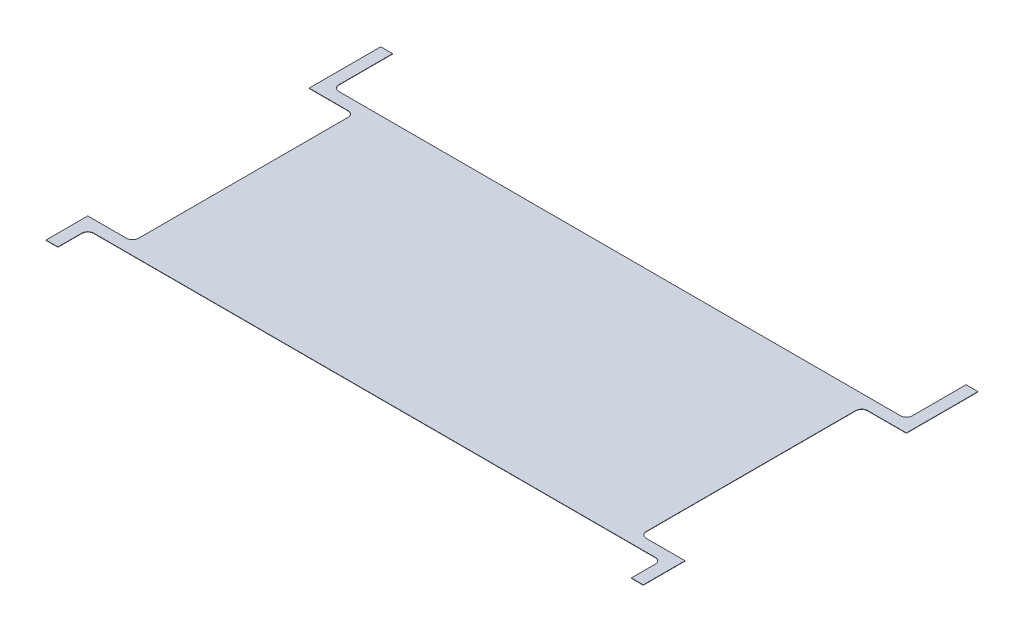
ISO-10303-21;
HEADER;
FILE_DESCRIPTION(('STEP AP214'),'2;1');
FILE_NAME('part.step','',(''),(''),'','','');
FILE_SCHEMA(('AUTOMOTIVE_DESIGN { 1 0 10303 214 1 1 1 1 }'));
ENDSEC;
DATA;
#1=APPLICATION_CONTEXT('core data for automotive mechanical design processes');
#2=APPLICATION_PROTOCOL_DEFINITION('international standard','automotive_design',2000,#1);
#3=PRODUCT_CONTEXT('',#1,'mechanical');
#4=PRODUCT('Part','Part','',(#3));
#5=PRODUCT_RELATED_PRODUCT_CATEGORY('part','',(#4));
#6=PRODUCT_DEFINITION_FORMATION('','',#4);
#7=PRODUCT_DEFINITION_CONTEXT('part definition',#1,'design');
#8=PRODUCT_DEFINITION('design','',#6,#7);
#9=PRODUCT_DEFINITION_SHAPE('','',#8);
#10=(LENGTH_UNIT() NAMED_UNIT(*) SI_UNIT(.MILLI.,.METRE.));
#11=(NAMED_UNIT(*) PLANE_ANGLE_UNIT() SI_UNIT($,.RADIAN.));
#12=(NAMED_UNIT(*) SI_UNIT($,.STERADIAN.) SOLID_ANGLE_UNIT());
#13=UNCERTAINTY_MEASURE_WITH_UNIT(LENGTH_MEASURE(1.E-05),#10,'distance_accuracy_value','');
#14=(GEOMETRIC_REPRESENTATION_CONTEXT(3) GLOBAL_UNCERTAINTY_ASSIGNED_CONTEXT((#13)) GLOBAL_UNIT_ASSIGNED_CONTEXT((#10,
#11,#12)) REPRESENTATION_CONTEXT('',''));
#15=CARTESIAN_POINT('',(0.,0.,0.));
#16=DIRECTION('',(0.,0.,1.));
#17=DIRECTION('',(1.,0.,0.));
#18=AXIS2_PLACEMENT_3D('',#15,#16,#17);
#19=CARTESIAN_POINT('',(0.,0.05,0.));
#20=DIRECTION('',(1.,0.,0.));
#21=DIRECTION('',(0.,0.,-1.));
#22=AXIS2_PLACEMENT_3D('',#19,#20,#21);
#23=PLANE('',#22);
#24=DIRECTION('',(0.,0.,1.));
#25=VECTOR('',#24,1.);
#26=CARTESIAN_POINT('',(0.,0.,0.));
#27=LINE('',#26,#25);
#28=CARTESIAN_POINT('',(0.,0.,-7.));
#29=VERTEX_POINT('',#28);
#30=CARTESIAN_POINT('',(0.,0.,0.));
#31=VERTEX_POINT('',#30);
#32=EDGE_CURVE('E253',#29,#31,#27,.T.);
#33=ORIENTED_EDGE('',*,*,#32,.T.);
#34=DIRECTION('',(0.,-1.,0.));
#35=VECTOR('',#34,1.);
#36=CARTESIAN_POINT('',(0.,0.05,0.));
#37=LINE('',#36,#35);
#38=CARTESIAN_POINT('',(0.,0.05,0.));
#39=VERTEX_POINT('',#38);
#40=EDGE_CURVE('E11',#39,#31,#37,.T.);
#41=ORIENTED_EDGE('',*,*,#40,.F.);
#42=DIRECTION('',(0.,0.,1.));
#43=VECTOR('',#42,1.);
#44=CARTESIAN_POINT('',(0.,0.05,0.));
#45=LINE('',#44,#43);
#46=CARTESIAN_POINT('',(0.,0.05,-7.));
#47=VERTEX_POINT('',#46);
#48=EDGE_CURVE('E307',#47,#39,#45,.T.);
#49=ORIENTED_EDGE('',*,*,#48,.F.);
#50=DIRECTION('',(0.,-1.,0.));
#51=VECTOR('',#50,1.);
#52=CARTESIAN_POINT('',(0.,0.05,-7.));
#53=LINE('',#52,#51);
#54=EDGE_CURVE('E249',#47,#29,#53,.T.);
#55=ORIENTED_EDGE('',*,*,#54,.T.);
#56=EDGE_LOOP('',(#33,#41,#49,#55));
#57=FACE_BOUND('',#56,.T.);
#58=ADVANCED_FACE('F37',(#57),#23,.F.);
#59=CARTESIAN_POINT('',(0.,0.05,0.));
#60=DIRECTION('',(0.,0.,-1.));
#61=DIRECTION('',(-1.,0.,0.));
#62=AXIS2_PLACEMENT_3D('',#59,#60,#61);
#63=PLANE('',#62);
#64=DIRECTION('',(1.,0.,0.));
#65=VECTOR('',#64,1.);
#66=CARTESIAN_POINT('',(0.,0.,0.));
#67=LINE('',#66,#65);
#68=CARTESIAN_POINT('',(2.,0.,0.));
#69=VERTEX_POINT('',#68);
#70=EDGE_CURVE('E256',#31,#69,#67,.T.);
#71=ORIENTED_EDGE('',*,*,#70,.T.);
#72=DIRECTION('',(0.,-1.,0.));
#73=VECTOR('',#72,1.);
#74=CARTESIAN_POINT('',(2.,0.05,0.));
#75=LINE('',#74,#73);
#76=CARTESIAN_POINT('',(2.,0.05,0.));
#77=VERTEX_POINT('',#76);
#78=EDGE_CURVE('E45',#77,#69,#75,.T.);
#79=ORIENTED_EDGE('',*,*,#78,.F.);
#80=DIRECTION('',(1.,0.,0.));
#81=VECTOR('',#80,1.);
#82=CARTESIAN_POINT('',(0.,0.05,0.));
#83=LINE('',#82,#81);
#84=EDGE_CURVE('E156',#39,#77,#83,.T.);
#85=ORIENTED_EDGE('',*,*,#84,.F.);
#86=ORIENTED_EDGE('',*,*,#40,.T.);
#87=EDGE_LOOP('',(#71,#79,#85,#86));
#88=FACE_BOUND('',#87,.T.);
#89=ADVANCED_FACE('F465',(#88),#63,.F.);
#90=CARTESIAN_POINT('',(2.,0.05,0.));
#91=DIRECTION('',(-1.,0.,0.));
#92=DIRECTION('',(0.,0.,1.));
#93=AXIS2_PLACEMENT_3D('',#90,#91,#92);
#94=PLANE('',#93);
#95=DIRECTION('',(0.,0.,-1.));
#96=VECTOR('',#95,1.);
#97=CARTESIAN_POINT('',(2.,0.,0.));
#98=LINE('',#97,#96);
#99=CARTESIAN_POINT('',(2.,0.,-3.99999999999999));
#100=VERTEX_POINT('',#99);
#101=EDGE_CURVE('E258',#69,#100,#98,.T.);
#102=ORIENTED_EDGE('',*,*,#101,.T.);
#103=DIRECTION('',(0.,-1.,0.));
#104=VECTOR('',#103,1.);
#105=CARTESIAN_POINT('',(2.,0.05,-3.99999999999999));
#106=LINE('',#105,#104);
#107=CARTESIAN_POINT('',(2.,0.05,-3.99999999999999));
#108=VERTEX_POINT('',#107);
#109=EDGE_CURVE('E374',#108,#100,#106,.T.);
#110=ORIENTED_EDGE('',*,*,#109,.F.);
#111=DIRECTION('',(0.,0.,-1.));
#112=VECTOR('',#111,1.);
#113=CARTESIAN_POINT('',(2.,0.05,0.));
#114=LINE('',#113,#112);
#115=EDGE_CURVE('E382',#77,#108,#114,.T.);
#116=ORIENTED_EDGE('',*,*,#115,.F.);
#117=ORIENTED_EDGE('',*,*,#78,.T.);
#118=EDGE_LOOP('',(#102,#110,#116,#117));
#119=FACE_BOUND('',#118,.T.);
#120=ADVANCED_FACE('F380',(#119),#94,.F.);
#121=CARTESIAN_POINT('',(3.,0.05,-4.));
#122=DIRECTION('',(0.,-1.,0.));
#123=DIRECTION('',(0.,0.,-1.));
#124=AXIS2_PLACEMENT_3D('',#121,#122,#123);
#125=CYLINDRICAL_SURFACE('',#124,1.);
#126=CARTESIAN_POINT('',(3.,0.,-4.));
#127=DIRECTION('',(0.,-1.,0.));
#128=DIRECTION('',(0.,0.,1.));
#129=AXIS2_PLACEMENT_3D('',#126,#127,#128);
#130=CIRCLE('',#129,1.);
#131=CARTESIAN_POINT('',(3.00000000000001,0.,-5.));
#132=VERTEX_POINT('',#131);
#133=EDGE_CURVE('E260',#100,#132,#130,.T.);
#134=ORIENTED_EDGE('',*,*,#133,.T.);
#135=DIRECTION('',(0.,-1.,0.));
#136=VECTOR('',#135,1.);
#137=CARTESIAN_POINT('',(3.00000000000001,0.05,-5.));
#138=LINE('',#137,#136);
#139=CARTESIAN_POINT('',(3.00000000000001,0.05,-5.));
#140=VERTEX_POINT('',#139);
#141=EDGE_CURVE('E371',#140,#132,#138,.T.);
#142=ORIENTED_EDGE('',*,*,#141,.F.);
#143=CARTESIAN_POINT('',(3.,0.05,-4.));
#144=DIRECTION('',(0.,-1.,0.));
#145=DIRECTION('',(0.,0.,1.));
#146=AXIS2_PLACEMENT_3D('',#143,#144,#145);
#147=CIRCLE('',#146,1.);
#148=EDGE_CURVE('E400',#108,#140,#147,.T.);
#149=ORIENTED_EDGE('',*,*,#148,.F.);
#150=ORIENTED_EDGE('',*,*,#109,.T.);
#151=EDGE_LOOP('',(#134,#142,#149,#150));
#152=FACE_BOUND('',#151,.T.);
#153=ADVANCED_FACE('F391',(#152),#125,.F.);
#154=CARTESIAN_POINT('',(3.00000000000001,0.05,-5.));
#155=DIRECTION('',(0.,0.,-1.));
#156=DIRECTION('',(-1.,0.,0.));
#157=AXIS2_PLACEMENT_3D('',#154,#155,#156);
#158=PLANE('',#157);
#159=DIRECTION('',(1.,0.,0.));
#160=VECTOR('',#159,1.);
#161=CARTESIAN_POINT('',(3.00000000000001,0.,-5.));
#162=LINE('',#161,#160);
#163=CARTESIAN_POINT('',(97.1,0.,-5.));
#164=VERTEX_POINT('',#163);
#165=EDGE_CURVE('E262',#132,#164,#162,.T.);
#166=ORIENTED_EDGE('',*,*,#165,.T.);
#167=DIRECTION('',(0.,-1.,0.));
#168=VECTOR('',#167,1.);
#169=CARTESIAN_POINT('',(97.1,0.05,-5.));
#170=LINE('',#169,#168);
#171=CARTESIAN_POINT('',(97.1,0.05,-5.));
#172=VERTEX_POINT('',#171);
#173=EDGE_CURVE('E368',#172,#164,#170,.T.);
#174=ORIENTED_EDGE('',*,*,#173,.F.);
#175=DIRECTION('',(1.,0.,0.));
#176=VECTOR('',#175,1.);
#177=CARTESIAN_POINT('',(3.00000000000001,0.05,-5.));
#178=LINE('',#177,#176);
#179=EDGE_CURVE('E397',#140,#172,#178,.T.);
#180=ORIENTED_EDGE('',*,*,#179,.F.);
#181=ORIENTED_EDGE('',*,*,#141,.T.);
#182=EDGE_LOOP('',(#166,#174,#180,#181));
#183=FACE_BOUND('',#182,.T.);
#184=ADVANCED_FACE('F395',(#183),#158,.F.);
#185=CARTESIAN_POINT('',(97.1,0.05,-4.));
#186=DIRECTION('',(0.,-1.,0.));
#187=DIRECTION('',(0.,0.,-1.));
#188=AXIS2_PLACEMENT_3D('',#185,#186,#187);
#189=CYLINDRICAL_SURFACE('',#188,1.);
#190=CARTESIAN_POINT('',(97.1,0.,-4.));
#191=DIRECTION('',(0.,-1.,0.));
#192=DIRECTION('',(0.,0.,1.));
#193=AXIS2_PLACEMENT_3D('',#190,#191,#192);
#194=CIRCLE('',#193,1.);
#195=CARTESIAN_POINT('',(98.1,0.,-3.99999999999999));
#196=VERTEX_POINT('',#195);
#197=EDGE_CURVE('E264',#164,#196,#194,.T.);
#198=ORIENTED_EDGE('',*,*,#197,.T.);
#199=DIRECTION('',(0.,-1.,0.));
#200=VECTOR('',#199,1.);
#201=CARTESIAN_POINT('',(98.1,0.05,-3.99999999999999));
#202=LINE('',#201,#200);
#203=CARTESIAN_POINT('',(98.1,0.05,-3.99999999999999));
#204=VERTEX_POINT('',#203);
#205=EDGE_CURVE('E365',#204,#196,#202,.T.);
#206=ORIENTED_EDGE('',*,*,#205,.F.);
#207=CARTESIAN_POINT('',(97.1,0.05,-4.));
#208=DIRECTION('',(0.,-1.,0.));
#209=DIRECTION('',(0.,0.,1.));
#210=AXIS2_PLACEMENT_3D('',#207,#208,#209);
#211=CIRCLE('',#210,1.);
#212=EDGE_CURVE('E399',#172,#204,#211,.T.);
#213=ORIENTED_EDGE('',*,*,#212,.F.);
#214=ORIENTED_EDGE('',*,*,#173,.T.);
#215=EDGE_LOOP('',(#198,#206,#213,#214));
#216=FACE_BOUND('',#215,.T.);
#217=ADVANCED_FACE('F478',(#216),#189,.F.);
#218=CARTESIAN_POINT('',(98.1,0.05,-3.99999999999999));
#219=DIRECTION('',(1.,0.,0.));
#220=DIRECTION('',(0.,0.,-1.));
#221=AXIS2_PLACEMENT_3D('',#218,#219,#220);
#222=PLANE('',#221);
#223=DIRECTION('',(0.,0.,1.));
#224=VECTOR('',#223,1.);
#225=CARTESIAN_POINT('',(98.1,0.,-3.99999999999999));
#226=LINE('',#225,#224);
#227=CARTESIAN_POINT('',(98.1,0.,0.));
#228=VERTEX_POINT('',#227);
#229=EDGE_CURVE('E266',#196,#228,#226,.T.);
#230=ORIENTED_EDGE('',*,*,#229,.T.);
#231=DIRECTION('',(0.,-1.,0.));
#232=VECTOR('',#231,1.);
#233=CARTESIAN_POINT('',(98.1,0.05,0.));
#234=LINE('',#233,#232);
#235=CARTESIAN_POINT('',(98.1,0.05,0.));
#236=VERTEX_POINT('',#235);
#237=EDGE_CURVE('E362',#236,#228,#234,.T.);
#238=ORIENTED_EDGE('',*,*,#237,.F.);
#239=DIRECTION('',(0.,0.,1.));
#240=VECTOR('',#239,1.);
#241=CARTESIAN_POINT('',(98.1,0.05,-3.99999999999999));
#242=LINE('',#241,#240);
#243=EDGE_CURVE('E402',#204,#236,#242,.T.);
#244=ORIENTED_EDGE('',*,*,#243,.F.);
#245=ORIENTED_EDGE('',*,*,#205,.T.);
#246=EDGE_LOOP('',(#230,#238,#244,#245));
#247=FACE_BOUND('',#246,.T.);
#248=ADVANCED_FACE('F481',(#247),#222,.F.);
#249=CARTESIAN_POINT('',(98.1,0.05,0.));
#250=DIRECTION('',(0.,0.,-1.));
#251=DIRECTION('',(-1.,0.,0.));
#252=AXIS2_PLACEMENT_3D('',#249,#250,#251);
#253=PLANE('',#252);
#254=DIRECTION('',(1.,0.,0.));
#255=VECTOR('',#254,1.);
#256=CARTESIAN_POINT('',(98.1,0.,0.));
#257=LINE('',#256,#255);
#258=CARTESIAN_POINT('',(100.1,0.,0.));
#259=VERTEX_POINT('',#258);
#260=EDGE_CURVE('E268',#228,#259,#257,.T.);
#261=ORIENTED_EDGE('',*,*,#260,.T.);
#262=DIRECTION('',(0.,-1.,0.));
#263=VECTOR('',#262,1.);
#264=CARTESIAN_POINT('',(100.1,0.05,0.));
#265=LINE('',#264,#263);
#266=CARTESIAN_POINT('',(100.1,0.05,0.));
#267=VERTEX_POINT('',#266);
#268=EDGE_CURVE('E359',#267,#259,#265,.T.);
#269=ORIENTED_EDGE('',*,*,#268,.F.);
#270=DIRECTION('',(1.,0.,0.));
#271=VECTOR('',#270,1.);
#272=CARTESIAN_POINT('',(98.1,0.05,0.));
#273=LINE('',#272,#271);
#274=EDGE_CURVE('E408',#236,#267,#273,.T.);
#275=ORIENTED_EDGE('',*,*,#274,.F.);
#276=ORIENTED_EDGE('',*,*,#237,.T.);
#277=EDGE_LOOP('',(#261,#269,#275,#276));
#278=FACE_BOUND('',#277,.T.);
#279=ADVANCED_FACE('F485',(#278),#253,.F.);
#280=CARTESIAN_POINT('',(100.1,0.05,0.));
#281=DIRECTION('',(-1.,0.,0.));
#282=DIRECTION('',(0.,0.,1.));
#283=AXIS2_PLACEMENT_3D('',#280,#281,#282);
#284=PLANE('',#283);
#285=DIRECTION('',(0.,0.,-1.));
#286=VECTOR('',#285,1.);
#287=CARTESIAN_POINT('',(100.1,0.,0.));
#288=LINE('',#287,#286);
#289=CARTESIAN_POINT('',(100.1,0.,-7.));
#290=VERTEX_POINT('',#289);
#291=EDGE_CURVE('E270',#259,#290,#288,.T.);
#292=ORIENTED_EDGE('',*,*,#291,.T.);
#293=DIRECTION('',(0.,-1.,0.));
#294=VECTOR('',#293,1.);
#295=CARTESIAN_POINT('',(100.1,0.05,-7.));
#296=LINE('',#295,#294);
#297=CARTESIAN_POINT('',(100.1,0.05,-7.));
#298=VERTEX_POINT('',#297);
#299=EDGE_CURVE('E356',#298,#290,#296,.T.);
#300=ORIENTED_EDGE('',*,*,#299,.F.);
#301=DIRECTION('',(0.,0.,-1.));
#302=VECTOR('',#301,1.);
#303=CARTESIAN_POINT('',(100.1,0.05,0.));
#304=LINE('',#303,#302);
#305=EDGE_CURVE('E410',#267,#298,#304,.T.);
#306=ORIENTED_EDGE('',*,*,#305,.F.);
#307=ORIENTED_EDGE('',*,*,#268,.T.);
#308=EDGE_LOOP('',(#292,#300,#306,#307));
#309=FACE_BOUND('',#308,.T.);
#310=ADVANCED_FACE('F489',(#309),#284,.F.);
#311=CARTESIAN_POINT('',(100.1,0.05,-7.));
#312=DIRECTION('',(0.,0.,1.));
#313=DIRECTION('',(1.,0.,0.));
#314=AXIS2_PLACEMENT_3D('',#311,#312,#313);
#315=PLANE('',#314);
#316=DIRECTION('',(-1.,0.,0.));
#317=VECTOR('',#316,1.);
#318=CARTESIAN_POINT('',(100.1,0.,-7.));
#319=LINE('',#318,#317);
#320=CARTESIAN_POINT('',(93.6,0.,-7.));
#321=VERTEX_POINT('',#320);
#322=EDGE_CURVE('E272',#290,#321,#319,.T.);
#323=ORIENTED_EDGE('',*,*,#322,.T.);
#324=DIRECTION('',(0.,-1.,0.));
#325=VECTOR('',#324,1.);
#326=CARTESIAN_POINT('',(93.6,0.05,-7.));
#327=LINE('',#326,#325);
#328=CARTESIAN_POINT('',(93.6,0.05,-7.));
#329=VERTEX_POINT('',#328);
#330=EDGE_CURVE('E353',#329,#321,#327,.T.);
#331=ORIENTED_EDGE('',*,*,#330,.F.);
#332=DIRECTION('',(-1.,0.,0.));
#333=VECTOR('',#332,1.);
#334=CARTESIAN_POINT('',(100.1,0.05,-7.));
#335=LINE('',#334,#333);
#336=EDGE_CURVE('E412',#298,#329,#335,.T.);
#337=ORIENTED_EDGE('',*,*,#336,.F.);
#338=ORIENTED_EDGE('',*,*,#299,.T.);
#339=EDGE_LOOP('',(#323,#331,#337,#338));
#340=FACE_BOUND('',#339,.T.);
#341=ADVANCED_FACE('F493',(#340),#315,.F.);
#342=CARTESIAN_POINT('',(93.6,0.05,-8.));
#343=DIRECTION('',(0.,-1.,0.));
#344=DIRECTION('',(0.,0.,-1.));
#345=AXIS2_PLACEMENT_3D('',#342,#343,#344);
#346=CYLINDRICAL_SURFACE('',#345,1.);
#347=CARTESIAN_POINT('',(93.6,0.,-8.));
#348=DIRECTION('',(0.,-1.,0.));
#349=DIRECTION('',(0.,0.,1.));
#350=AXIS2_PLACEMENT_3D('',#347,#348,#349);
#351=CIRCLE('',#350,1.);
#352=CARTESIAN_POINT('',(92.6,0.,-8.00000000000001));
#353=VERTEX_POINT('',#352);
#354=EDGE_CURVE('E274',#321,#353,#351,.T.);
#355=ORIENTED_EDGE('',*,*,#354,.T.);
#356=DIRECTION('',(0.,-1.,0.));
#357=VECTOR('',#356,1.);
#358=CARTESIAN_POINT('',(92.6,0.05,-8.00000000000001));
#359=LINE('',#358,#357);
#360=CARTESIAN_POINT('',(92.6,0.05,-8.00000000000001));
#361=VERTEX_POINT('',#360);
#362=EDGE_CURVE('E350',#361,#353,#359,.T.);
#363=ORIENTED_EDGE('',*,*,#362,.F.);
#364=CARTESIAN_POINT('',(93.6,0.05,-8.));
#365=DIRECTION('',(0.,-1.,0.));
#366=DIRECTION('',(0.,0.,1.));
#367=AXIS2_PLACEMENT_3D('',#364,#365,#366);
#368=CIRCLE('',#367,1.);
#369=EDGE_CURVE('E414',#329,#361,#368,.T.);
#370=ORIENTED_EDGE('',*,*,#369,.F.);
#371=ORIENTED_EDGE('',*,*,#330,.T.);
#372=EDGE_LOOP('',(#355,#363,#370,#371));
#373=FACE_BOUND('',#372,.T.);
#374=ADVANCED_FACE('F497',(#373),#346,.F.);
#375=CARTESIAN_POINT('',(92.6,0.05,-8.00000000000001));
#376=DIRECTION('',(-1.,0.,0.));
#377=DIRECTION('',(0.,0.,1.));
#378=AXIS2_PLACEMENT_3D('',#375,#376,#377);
#379=PLANE('',#378);
#380=DIRECTION('',(0.,0.,-1.));
#381=VECTOR('',#380,1.);
#382=CARTESIAN_POINT('',(92.6,0.,-8.00000000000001));
#383=LINE('',#382,#381);
#384=CARTESIAN_POINT('',(92.6,0.,-43.1));
#385=VERTEX_POINT('',#384);
#386=EDGE_CURVE('E276',#353,#385,#383,.T.);
#387=ORIENTED_EDGE('',*,*,#386,.T.);
#388=DIRECTION('',(0.,-1.,0.));
#389=VECTOR('',#388,1.);
#390=CARTESIAN_POINT('',(92.6,0.05,-43.1));
#391=LINE('',#390,#389);
#392=CARTESIAN_POINT('',(92.6,0.05,-43.1));
#393=VERTEX_POINT('',#392);
#394=EDGE_CURVE('E347',#393,#385,#391,.T.);
#395=ORIENTED_EDGE('',*,*,#394,.F.);
#396=DIRECTION('',(0.,0.,-1.));
#397=VECTOR('',#396,1.);
#398=CARTESIAN_POINT('',(92.6,0.05,-8.00000000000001));
#399=LINE('',#398,#397);
#400=EDGE_CURVE('E416',#361,#393,#399,.T.);
#401=ORIENTED_EDGE('',*,*,#400,.F.);
#402=ORIENTED_EDGE('',*,*,#362,.T.);
#403=EDGE_LOOP('',(#387,#395,#401,#402));
#404=FACE_BOUND('',#403,.T.);
#405=ADVANCED_FACE('F501',(#404),#379,.F.);
#406=CARTESIAN_POINT('',(93.6,0.05,-43.1));
#407=DIRECTION('',(0.,-1.,0.));
#408=DIRECTION('',(0.,0.,-1.));
#409=AXIS2_PLACEMENT_3D('',#406,#407,#408);
#410=CYLINDRICAL_SURFACE('',#409,1.);
#411=CARTESIAN_POINT('',(93.6,0.,-43.1));
#412=DIRECTION('',(0.,-1.,0.));
#413=DIRECTION('',(0.,0.,-1.));
#414=AXIS2_PLACEMENT_3D('',#411,#412,#413);
#415=CIRCLE('',#414,1.);
#416=CARTESIAN_POINT('',(93.6,0.,-44.1));
#417=VERTEX_POINT('',#416);
#418=EDGE_CURVE('E278',#385,#417,#415,.T.);
#419=ORIENTED_EDGE('',*,*,#418,.T.);
#420=DIRECTION('',(0.,-1.,0.));
#421=VECTOR('',#420,1.);
#422=CARTESIAN_POINT('',(93.6,0.05,-44.1));
#423=LINE('',#422,#421);
#424=CARTESIAN_POINT('',(93.6,0.05,-44.1));
#425=VERTEX_POINT('',#424);
#426=EDGE_CURVE('E344',#425,#417,#423,.T.);
#427=ORIENTED_EDGE('',*,*,#426,.F.);
#428=CARTESIAN_POINT('',(93.6,0.05,-43.1));
#429=DIRECTION('',(0.,-1.,0.));
#430=DIRECTION('',(0.,0.,-1.));
#431=AXIS2_PLACEMENT_3D('',#428,#429,#430);
#432=CIRCLE('',#431,1.);
#433=EDGE_CURVE('E418',#393,#425,#432,.T.);
#434=ORIENTED_EDGE('',*,*,#433,.F.);
#435=ORIENTED_EDGE('',*,*,#394,.T.);
#436=EDGE_LOOP('',(#419,#427,#434,#435));
#437=FACE_BOUND('',#436,.T.);
#438=ADVANCED_FACE('F505',(#437),#410,.F.);
#439=CARTESIAN_POINT('',(93.6,0.05,-44.1));
#440=DIRECTION('',(0.,0.,-1.));
#441=DIRECTION('',(-1.,0.,0.));
#442=AXIS2_PLACEMENT_3D('',#439,#440,#441);
#443=PLANE('',#442);
#444=DIRECTION('',(1.,0.,0.));
#445=VECTOR('',#444,1.);
#446=CARTESIAN_POINT('',(93.6,0.,-44.1));
#447=LINE('',#446,#445);
#448=CARTESIAN_POINT('',(100.1,0.,-44.1));
#449=VERTEX_POINT('',#448);
#450=EDGE_CURVE('E280',#417,#449,#447,.T.);
#451=ORIENTED_EDGE('',*,*,#450,.T.);
#452=DIRECTION('',(0.,-1.,0.));
#453=VECTOR('',#452,1.);
#454=CARTESIAN_POINT('',(100.1,0.05,-44.1));
#455=LINE('',#454,#453);
#456=CARTESIAN_POINT('',(100.1,0.05,-44.1));
#457=VERTEX_POINT('',#456);
#458=EDGE_CURVE('E341',#457,#449,#455,.T.);
#459=ORIENTED_EDGE('',*,*,#458,.F.);
#460=DIRECTION('',(1.,0.,0.));
#461=VECTOR('',#460,1.);
#462=CARTESIAN_POINT('',(93.6,0.05,-44.1));
#463=LINE('',#462,#461);
#464=EDGE_CURVE('E420',#425,#457,#463,.T.);
#465=ORIENTED_EDGE('',*,*,#464,.F.);
#466=ORIENTED_EDGE('',*,*,#426,.T.);
#467=EDGE_LOOP('',(#451,#459,#465,#466));
#468=FACE_BOUND('',#467,.T.);
#469=ADVANCED_FACE('F509',(#468),#443,.F.);
#470=CARTESIAN_POINT('',(100.1,0.05,-44.1));
#471=DIRECTION('',(-1.,0.,0.));
#472=DIRECTION('',(0.,0.,1.));
#473=AXIS2_PLACEMENT_3D('',#470,#471,#472);
#474=PLANE('',#473);
#475=DIRECTION('',(0.,0.,-1.));
#476=VECTOR('',#475,1.);
#477=CARTESIAN_POINT('',(100.1,0.,-44.1));
#478=LINE('',#477,#476);
#479=CARTESIAN_POINT('',(100.1,0.,-56.1));
#480=VERTEX_POINT('',#479);
#481=EDGE_CURVE('E282',#449,#480,#478,.T.);
#482=ORIENTED_EDGE('',*,*,#481,.T.);
#483=DIRECTION('',(0.,-1.,0.));
#484=VECTOR('',#483,1.);
#485=CARTESIAN_POINT('',(100.1,0.05,-56.1));
#486=LINE('',#485,#484);
#487=CARTESIAN_POINT('',(100.1,0.05,-56.1));
#488=VERTEX_POINT('',#487);
#489=EDGE_CURVE('E338',#488,#480,#486,.T.);
#490=ORIENTED_EDGE('',*,*,#489,.F.);
#491=DIRECTION('',(0.,0.,-1.));
#492=VECTOR('',#491,1.);
#493=CARTESIAN_POINT('',(100.1,0.05,-44.1));
#494=LINE('',#493,#492);
#495=EDGE_CURVE('E422',#457,#488,#494,.T.);
#496=ORIENTED_EDGE('',*,*,#495,.F.);
#497=ORIENTED_EDGE('',*,*,#458,.T.);
#498=EDGE_LOOP('',(#482,#490,#496,#497));
#499=FACE_BOUND('',#498,.T.);
#500=ADVANCED_FACE('F513',(#499),#474,.F.);
#501=CARTESIAN_POINT('',(100.1,0.05,-56.1));
#502=DIRECTION('',(0.,0.,1.));
#503=DIRECTION('',(1.,0.,0.));
#504=AXIS2_PLACEMENT_3D('',#501,#502,#503);
#505=PLANE('',#504);
#506=DIRECTION('',(-1.,0.,0.));
#507=VECTOR('',#506,1.);
#508=CARTESIAN_POINT('',(100.1,0.,-56.1));
#509=LINE('',#508,#507);
#510=CARTESIAN_POINT('',(98.1,0.,-56.1));
#511=VERTEX_POINT('',#510);
#512=EDGE_CURVE('E284',#480,#511,#509,.T.);
#513=ORIENTED_EDGE('',*,*,#512,.T.);
#514=DIRECTION('',(0.,-1.,0.));
#515=VECTOR('',#514,1.);
#516=CARTESIAN_POINT('',(98.1,0.05,-56.1));
#517=LINE('',#516,#515);
#518=CARTESIAN_POINT('',(98.1,0.05,-56.1));
#519=VERTEX_POINT('',#518);
#520=EDGE_CURVE('E335',#519,#511,#517,.T.);
#521=ORIENTED_EDGE('',*,*,#520,.F.);
#522=DIRECTION('',(-1.,0.,0.));
#523=VECTOR('',#522,1.);
#524=CARTESIAN_POINT('',(100.1,0.05,-56.1));
#525=LINE('',#524,#523);
#526=EDGE_CURVE('E424',#488,#519,#525,.T.);
#527=ORIENTED_EDGE('',*,*,#526,.F.);
#528=ORIENTED_EDGE('',*,*,#489,.T.);
#529=EDGE_LOOP('',(#513,#521,#527,#528));
#530=FACE_BOUND('',#529,.T.);
#531=ADVANCED_FACE('F517',(#530),#505,.F.);
#532=CARTESIAN_POINT('',(98.1,0.05,-56.1));
#533=DIRECTION('',(1.,0.,0.));
#534=DIRECTION('',(0.,0.,-1.));
#535=AXIS2_PLACEMENT_3D('',#532,#533,#534);
#536=PLANE('',#535);
#537=DIRECTION('',(0.,0.,1.));
#538=VECTOR('',#537,1.);
#539=CARTESIAN_POINT('',(98.1,0.,-56.1));
#540=LINE('',#539,#538);
#541=CARTESIAN_POINT('',(98.1,0.,-47.1));
#542=VERTEX_POINT('',#541);
#543=EDGE_CURVE('E286',#511,#542,#540,.T.);
#544=ORIENTED_EDGE('',*,*,#543,.T.);
#545=DIRECTION('',(0.,-1.,0.));
#546=VECTOR('',#545,1.);
#547=CARTESIAN_POINT('',(98.1,0.05,-47.1));
#548=LINE('',#547,#546);
#549=CARTESIAN_POINT('',(98.1,0.05,-47.1));
#550=VERTEX_POINT('',#549);
#551=EDGE_CURVE('E332',#550,#542,#548,.T.);
#552=ORIENTED_EDGE('',*,*,#551,.F.);
#553=DIRECTION('',(0.,0.,1.));
#554=VECTOR('',#553,1.);
#555=CARTESIAN_POINT('',(98.1,0.05,-56.1));
#556=LINE('',#555,#554);
#557=EDGE_CURVE('E426',#519,#550,#556,.T.);
#558=ORIENTED_EDGE('',*,*,#557,.F.);
#559=ORIENTED_EDGE('',*,*,#520,.T.);
#560=EDGE_LOOP('',(#544,#552,#558,#559));
#561=FACE_BOUND('',#560,.T.);
#562=ADVANCED_FACE('F521',(#561),#536,.F.);
#563=CARTESIAN_POINT('',(97.1,0.05,-47.1));
#564=DIRECTION('',(0.,-1.,0.));
#565=DIRECTION('',(0.,0.,-1.));
#566=AXIS2_PLACEMENT_3D('',#563,#564,#565);
#567=CYLINDRICAL_SURFACE('',#566,1.);
#568=CARTESIAN_POINT('',(97.1,0.,-47.1));
#569=DIRECTION('',(0.,-1.,0.));
#570=DIRECTION('',(0.,0.,-1.));
#571=AXIS2_PLACEMENT_3D('',#568,#569,#570);
#572=CIRCLE('',#571,1.);
#573=CARTESIAN_POINT('',(97.1,0.,-46.1));
#574=VERTEX_POINT('',#573);
#575=EDGE_CURVE('E288',#542,#574,#572,.T.);
#576=ORIENTED_EDGE('',*,*,#575,.T.);
#577=DIRECTION('',(0.,-1.,0.));
#578=VECTOR('',#577,1.);
#579=CARTESIAN_POINT('',(97.1,0.05,-46.1));
#580=LINE('',#579,#578);
#581=CARTESIAN_POINT('',(97.1,0.05,-46.1));
#582=VERTEX_POINT('',#581);
#583=EDGE_CURVE('E329',#582,#574,#580,.T.);
#584=ORIENTED_EDGE('',*,*,#583,.F.);
#585=CARTESIAN_POINT('',(97.1,0.05,-47.1));
#586=DIRECTION('',(0.,-1.,0.));
#587=DIRECTION('',(0.,0.,-1.));
#588=AXIS2_PLACEMENT_3D('',#585,#586,#587);
#589=CIRCLE('',#588,1.);
#590=EDGE_CURVE('E428',#550,#582,#589,.T.);
#591=ORIENTED_EDGE('',*,*,#590,.F.);
#592=ORIENTED_EDGE('',*,*,#551,.T.);
#593=EDGE_LOOP('',(#576,#584,#591,#592));
#594=FACE_BOUND('',#593,.T.);
#595=ADVANCED_FACE('F525',(#594),#567,.F.);
#596=CARTESIAN_POINT('',(97.1,0.05,-46.1));
#597=DIRECTION('',(0.,0.,1.));
#598=DIRECTION('',(1.,0.,0.));
#599=AXIS2_PLACEMENT_3D('',#596,#597,#598);
#600=PLANE('',#599);
#601=DIRECTION('',(-1.,0.,0.));
#602=VECTOR('',#601,1.);
#603=CARTESIAN_POINT('',(97.1,0.,-46.1));
#604=LINE('',#603,#602);
#605=CARTESIAN_POINT('',(3.00000000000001,0.,-46.1));
#606=VERTEX_POINT('',#605);
#607=EDGE_CURVE('E290',#574,#606,#604,.T.);
#608=ORIENTED_EDGE('',*,*,#607,.T.);
#609=DIRECTION('',(0.,-1.,0.));
#610=VECTOR('',#609,1.);
#611=CARTESIAN_POINT('',(3.00000000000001,0.05,-46.1));
#612=LINE('',#611,#610);
#613=CARTESIAN_POINT('',(3.00000000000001,0.05,-46.1));
#614=VERTEX_POINT('',#613);
#615=EDGE_CURVE('E326',#614,#606,#612,.T.);
#616=ORIENTED_EDGE('',*,*,#615,.F.);
#617=DIRECTION('',(-1.,0.,0.));
#618=VECTOR('',#617,1.);
#619=CARTESIAN_POINT('',(97.1,0.05,-46.1));
#620=LINE('',#619,#618);
#621=EDGE_CURVE('E430',#582,#614,#620,.T.);
#622=ORIENTED_EDGE('',*,*,#621,.F.);
#623=ORIENTED_EDGE('',*,*,#583,.T.);
#624=EDGE_LOOP('',(#608,#616,#622,#623));
#625=FACE_BOUND('',#624,.T.);
#626=ADVANCED_FACE('F529',(#625),#600,.F.);
#627=CARTESIAN_POINT('',(3.,0.05,-47.1));
#628=DIRECTION('',(0.,-1.,0.));
#629=DIRECTION('',(0.,0.,-1.));
#630=AXIS2_PLACEMENT_3D('',#627,#628,#629);
#631=CYLINDRICAL_SURFACE('',#630,1.);
#632=CARTESIAN_POINT('',(3.,0.,-47.1));
#633=DIRECTION('',(0.,-1.,0.));
#634=DIRECTION('',(0.,0.,-1.));
#635=AXIS2_PLACEMENT_3D('',#632,#633,#634);
#636=CIRCLE('',#635,1.);
#637=CARTESIAN_POINT('',(2.,0.,-47.1));
#638=VERTEX_POINT('',#637);
#639=EDGE_CURVE('E292',#606,#638,#636,.T.);
#640=ORIENTED_EDGE('',*,*,#639,.T.);
#641=DIRECTION('',(0.,-1.,0.));
#642=VECTOR('',#641,1.);
#643=CARTESIAN_POINT('',(2.,0.05,-47.1));
#644=LINE('',#643,#642);
#645=CARTESIAN_POINT('',(2.,0.05,-47.1));
#646=VERTEX_POINT('',#645);
#647=EDGE_CURVE('E323',#646,#638,#644,.T.);
#648=ORIENTED_EDGE('',*,*,#647,.F.);
#649=CARTESIAN_POINT('',(3.,0.05,-47.1));
#650=DIRECTION('',(0.,-1.,0.));
#651=DIRECTION('',(0.,0.,-1.));
#652=AXIS2_PLACEMENT_3D('',#649,#650,#651);
#653=CIRCLE('',#652,1.);
#654=EDGE_CURVE('E432',#614,#646,#653,.T.);
#655=ORIENTED_EDGE('',*,*,#654,.F.);
#656=ORIENTED_EDGE('',*,*,#615,.T.);
#657=EDGE_LOOP('',(#640,#648,#655,#656));
#658=FACE_BOUND('',#657,.T.);
#659=ADVANCED_FACE('F533',(#658),#631,.F.);
#660=CARTESIAN_POINT('',(2.,0.05,-47.1));
#661=DIRECTION('',(-1.,0.,0.));
#662=DIRECTION('',(0.,0.,1.));
#663=AXIS2_PLACEMENT_3D('',#660,#661,#662);
#664=PLANE('',#663);
#665=DIRECTION('',(0.,0.,-1.));
#666=VECTOR('',#665,1.);
#667=CARTESIAN_POINT('',(2.,0.,-47.1));
#668=LINE('',#667,#666);
#669=CARTESIAN_POINT('',(2.,0.,-56.1));
#670=VERTEX_POINT('',#669);
#671=EDGE_CURVE('E294',#638,#670,#668,.T.);
#672=ORIENTED_EDGE('',*,*,#671,.T.);
#673=DIRECTION('',(0.,-1.,0.));
#674=VECTOR('',#673,1.);
#675=CARTESIAN_POINT('',(2.,0.05,-56.1));
#676=LINE('',#675,#674);
#677=CARTESIAN_POINT('',(2.,0.05,-56.1));
#678=VERTEX_POINT('',#677);
#679=EDGE_CURVE('E320',#678,#670,#676,.T.);
#680=ORIENTED_EDGE('',*,*,#679,.F.);
#681=DIRECTION('',(0.,0.,-1.));
#682=VECTOR('',#681,1.);
#683=CARTESIAN_POINT('',(2.,0.05,-47.1));
#684=LINE('',#683,#682);
#685=EDGE_CURVE('E434',#646,#678,#684,.T.);
#686=ORIENTED_EDGE('',*,*,#685,.F.);
#687=ORIENTED_EDGE('',*,*,#647,.T.);
#688=EDGE_LOOP('',(#672,#680,#686,#687));
#689=FACE_BOUND('',#688,.T.);
#690=ADVANCED_FACE('F537',(#689),#664,.F.);
#691=CARTESIAN_POINT('',(2.,0.05,-56.1));
#692=DIRECTION('',(0.,0.,1.));
#693=DIRECTION('',(1.,0.,0.));
#694=AXIS2_PLACEMENT_3D('',#691,#692,#693);
#695=PLANE('',#694);
#696=DIRECTION('',(-1.,0.,0.));
#697=VECTOR('',#696,1.);
#698=CARTESIAN_POINT('',(2.,0.,-56.1));
#699=LINE('',#698,#697);
#700=CARTESIAN_POINT('',(0.,0.,-56.1));
#701=VERTEX_POINT('',#700);
#702=EDGE_CURVE('E296',#670,#701,#699,.T.);
#703=ORIENTED_EDGE('',*,*,#702,.T.);
#704=DIRECTION('',(0.,-1.,0.));
#705=VECTOR('',#704,1.);
#706=CARTESIAN_POINT('',(0.,0.05,-56.1));
#707=LINE('',#706,#705);
#708=CARTESIAN_POINT('',(0.,0.05,-56.1));
#709=VERTEX_POINT('',#708);
#710=EDGE_CURVE('E317',#709,#701,#707,.T.);
#711=ORIENTED_EDGE('',*,*,#710,.F.);
#712=DIRECTION('',(-1.,0.,0.));
#713=VECTOR('',#712,1.);
#714=CARTESIAN_POINT('',(2.,0.05,-56.1));
#715=LINE('',#714,#713);
#716=EDGE_CURVE('E436',#678,#709,#715,.T.);
#717=ORIENTED_EDGE('',*,*,#716,.F.);
#718=ORIENTED_EDGE('',*,*,#679,.T.);
#719=EDGE_LOOP('',(#703,#711,#717,#718));
#720=FACE_BOUND('',#719,.T.);
#721=ADVANCED_FACE('F541',(#720),#695,.F.);
#722=CARTESIAN_POINT('',(0.,0.05,-56.1));
#723=DIRECTION('',(1.,0.,0.));
#724=DIRECTION('',(0.,0.,-1.));
#725=AXIS2_PLACEMENT_3D('',#722,#723,#724);
#726=PLANE('',#725);
#727=DIRECTION('',(0.,0.,1.));
#728=VECTOR('',#727,1.);
#729=CARTESIAN_POINT('',(0.,0.,-56.1));
#730=LINE('',#729,#728);
#731=CARTESIAN_POINT('',(0.,0.,-44.1));
#732=VERTEX_POINT('',#731);
#733=EDGE_CURVE('E298',#701,#732,#730,.T.);
#734=ORIENTED_EDGE('',*,*,#733,.T.);
#735=DIRECTION('',(0.,-1.,0.));
#736=VECTOR('',#735,1.);
#737=CARTESIAN_POINT('',(0.,0.05,-44.1));
#738=LINE('',#737,#736);
#739=CARTESIAN_POINT('',(0.,0.05,-44.1));
#740=VERTEX_POINT('',#739);
#741=EDGE_CURVE('E314',#740,#732,#738,.T.);
#742=ORIENTED_EDGE('',*,*,#741,.F.);
#743=DIRECTION('',(0.,0.,1.));
#744=VECTOR('',#743,1.);
#745=CARTESIAN_POINT('',(0.,0.05,-56.1));
#746=LINE('',#745,#744);
#747=EDGE_CURVE('E438',#709,#740,#746,.T.);
#748=ORIENTED_EDGE('',*,*,#747,.F.);
#749=ORIENTED_EDGE('',*,*,#710,.T.);
#750=EDGE_LOOP('',(#734,#742,#748,#749));
#751=FACE_BOUND('',#750,.T.);
#752=ADVANCED_FACE('F545',(#751),#726,.F.);
#753=CARTESIAN_POINT('',(0.,0.05,-44.1));
#754=DIRECTION('',(0.,0.,-1.));
#755=DIRECTION('',(-1.,0.,0.));
#756=AXIS2_PLACEMENT_3D('',#753,#754,#755);
#757=PLANE('',#756);
#758=DIRECTION('',(1.,0.,0.));
#759=VECTOR('',#758,1.);
#760=CARTESIAN_POINT('',(0.,0.,-44.1));
#761=LINE('',#760,#759);
#762=CARTESIAN_POINT('',(6.5,0.,-44.1));
#763=VERTEX_POINT('',#762);
#764=EDGE_CURVE('E300',#732,#763,#761,.T.);
#765=ORIENTED_EDGE('',*,*,#764,.T.);
#766=DIRECTION('',(0.,-1.,0.));
#767=VECTOR('',#766,1.);
#768=CARTESIAN_POINT('',(6.5,0.05,-44.1));
#769=LINE('',#768,#767);
#770=CARTESIAN_POINT('',(6.5,0.05,-44.1));
#771=VERTEX_POINT('',#770);
#772=EDGE_CURVE('E311',#771,#763,#769,.T.);
#773=ORIENTED_EDGE('',*,*,#772,.F.);
#774=DIRECTION('',(1.,0.,0.));
#775=VECTOR('',#774,1.);
#776=CARTESIAN_POINT('',(0.,0.05,-44.1));
#777=LINE('',#776,#775);
#778=EDGE_CURVE('E440',#740,#771,#777,.T.);
#779=ORIENTED_EDGE('',*,*,#778,.F.);
#780=ORIENTED_EDGE('',*,*,#741,.T.);
#781=EDGE_LOOP('',(#765,#773,#779,#780));
#782=FACE_BOUND('',#781,.T.);
#783=ADVANCED_FACE('F446',(#782),#757,.F.);
#784=CARTESIAN_POINT('',(6.5,0.05,-43.1));
#785=DIRECTION('',(0.,-1.,0.));
#786=DIRECTION('',(0.,0.,-1.));
#787=AXIS2_PLACEMENT_3D('',#784,#785,#786);
#788=CYLINDRICAL_SURFACE('',#787,1.);
#789=CARTESIAN_POINT('',(6.5,0.,-43.1));
#790=DIRECTION('',(0.,-1.,0.));
#791=DIRECTION('',(0.,0.,1.));
#792=AXIS2_PLACEMENT_3D('',#789,#790,#791);
#793=CIRCLE('',#792,1.);
#794=CARTESIAN_POINT('',(7.5,0.,-43.1));
#795=VERTEX_POINT('',#794);
#796=EDGE_CURVE('E302',#763,#795,#793,.T.);
#797=ORIENTED_EDGE('',*,*,#796,.T.);
#798=DIRECTION('',(0.,-1.,0.));
#799=VECTOR('',#798,1.);
#800=CARTESIAN_POINT('',(7.5,0.05,-43.1));
#801=LINE('',#800,#799);
#802=CARTESIAN_POINT('',(7.5,0.05,-43.1));
#803=VERTEX_POINT('',#802);
#804=EDGE_CURVE('E244',#803,#795,#801,.T.);
#805=ORIENTED_EDGE('',*,*,#804,.F.);
#806=CARTESIAN_POINT('',(6.5,0.05,-43.1));
#807=DIRECTION('',(0.,-1.,0.));
#808=DIRECTION('',(0.,0.,1.));
#809=AXIS2_PLACEMENT_3D('',#806,#807,#808);
#810=CIRCLE('',#809,1.);
#811=EDGE_CURVE('E235',#771,#803,#810,.T.);
#812=ORIENTED_EDGE('',*,*,#811,.F.);
#813=ORIENTED_EDGE('',*,*,#772,.T.);
#814=EDGE_LOOP('',(#797,#805,#812,#813));
#815=FACE_BOUND('',#814,.T.);
#816=ADVANCED_FACE('F450',(#815),#788,.F.);
#817=CARTESIAN_POINT('',(7.5,0.05,-43.1));
#818=DIRECTION('',(1.,0.,0.));
#819=DIRECTION('',(0.,0.,-1.));
#820=AXIS2_PLACEMENT_3D('',#817,#818,#819);
#821=PLANE('',#820);
#822=DIRECTION('',(0.,0.,1.));
#823=VECTOR('',#822,1.);
#824=CARTESIAN_POINT('',(7.5,0.,-43.1));
#825=LINE('',#824,#823);
#826=CARTESIAN_POINT('',(7.5,0.,-8.00000000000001));
#827=VERTEX_POINT('',#826);
#828=EDGE_CURVE('E243',#795,#827,#825,.T.);
#829=ORIENTED_EDGE('',*,*,#828,.T.);
#830=DIRECTION('',(0.,-1.,0.));
#831=VECTOR('',#830,1.);
#832=CARTESIAN_POINT('',(7.5,0.05,-8.00000000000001));
#833=LINE('',#832,#831);
#834=CARTESIAN_POINT('',(7.5,0.05,-8.00000000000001));
#835=VERTEX_POINT('',#834);
#836=EDGE_CURVE('E240',#835,#827,#833,.T.);
#837=ORIENTED_EDGE('',*,*,#836,.F.);
#838=DIRECTION('',(0.,0.,1.));
#839=VECTOR('',#838,1.);
#840=CARTESIAN_POINT('',(7.5,0.05,-43.1));
#841=LINE('',#840,#839);
#842=EDGE_CURVE('E229',#803,#835,#841,.T.);
#843=ORIENTED_EDGE('',*,*,#842,.F.);
#844=ORIENTED_EDGE('',*,*,#804,.T.);
#845=EDGE_LOOP('',(#829,#837,#843,#844));
#846=FACE_BOUND('',#845,.T.);
#847=ADVANCED_FACE('F241',(#846),#821,.F.);
#848=CARTESIAN_POINT('',(6.5,0.05,-8.));
#849=DIRECTION('',(0.,-1.,0.));
#850=DIRECTION('',(0.,0.,-1.));
#851=AXIS2_PLACEMENT_3D('',#848,#849,#850);
#852=CYLINDRICAL_SURFACE('',#851,1.);
#853=CARTESIAN_POINT('',(6.5,0.,-8.));
#854=DIRECTION('',(0.,-1.,0.));
#855=DIRECTION('',(0.,0.,-1.));
#856=AXIS2_PLACEMENT_3D('',#853,#854,#855);
#857=CIRCLE('',#856,1.);
#858=CARTESIAN_POINT('',(6.49999999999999,0.,-7.));
#859=VERTEX_POINT('',#858);
#860=EDGE_CURVE('E142',#827,#859,#857,.T.);
#861=ORIENTED_EDGE('',*,*,#860,.T.);
#862=DIRECTION('',(0.,-1.,0.));
#863=VECTOR('',#862,1.);
#864=CARTESIAN_POINT('',(6.49999999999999,0.05,-7.));
#865=LINE('',#864,#863);
#866=CARTESIAN_POINT('',(6.49999999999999,0.05,-7.));
#867=VERTEX_POINT('',#866);
#868=EDGE_CURVE('E245',#867,#859,#865,.T.);
#869=ORIENTED_EDGE('',*,*,#868,.F.);
#870=CARTESIAN_POINT('',(6.5,0.05,-8.));
#871=DIRECTION('',(0.,-1.,0.));
#872=DIRECTION('',(0.,0.,-1.));
#873=AXIS2_PLACEMENT_3D('',#870,#871,#872);
#874=CIRCLE('',#873,1.);
#875=EDGE_CURVE('E233',#835,#867,#874,.T.);
#876=ORIENTED_EDGE('',*,*,#875,.F.);
#877=ORIENTED_EDGE('',*,*,#836,.T.);
#878=EDGE_LOOP('',(#861,#869,#876,#877));
#879=FACE_BOUND('',#878,.T.);
#880=ADVANCED_FACE('F247',(#879),#852,.F.);
#881=CARTESIAN_POINT('',(0.,0.05,-7.));
#882=DIRECTION('',(0.,0.,1.));
#883=DIRECTION('',(1.,0.,0.));
#884=AXIS2_PLACEMENT_3D('',#881,#882,#883);
#885=PLANE('',#884);
#886=DIRECTION('',(-1.,0.,0.));
#887=VECTOR('',#886,1.);
#888=CARTESIAN_POINT('',(0.,0.,-7.));
#889=LINE('',#888,#887);
#890=EDGE_CURVE('E148',#859,#29,#889,.T.);
#891=ORIENTED_EDGE('',*,*,#890,.T.);
#892=ORIENTED_EDGE('',*,*,#54,.F.);
#893=DIRECTION('',(-1.,0.,0.));
#894=VECTOR('',#893,1.);
#895=CARTESIAN_POINT('',(0.,0.05,-7.));
#896=LINE('',#895,#894);
#897=EDGE_CURVE('E53',#867,#47,#896,.T.);
#898=ORIENTED_EDGE('',*,*,#897,.F.);
#899=ORIENTED_EDGE('',*,*,#868,.T.);
#900=EDGE_LOOP('',(#891,#892,#898,#899));
#901=FACE_BOUND('',#900,.T.);
#902=ADVANCED_FACE('F454',(#901),#885,.F.);
#903=CARTESIAN_POINT('',(6.5,0.05,-8.));
#904=DIRECTION('',(0.,-1.,0.));
#905=DIRECTION('',(0.,0.,-1.));
#906=AXIS2_PLACEMENT_3D('',#903,#904,#905);
#907=PLANE('',#906);
#908=ORIENTED_EDGE('',*,*,#48,.T.);
#909=ORIENTED_EDGE('',*,*,#84,.T.);
#910=ORIENTED_EDGE('',*,*,#115,.T.);
#911=ORIENTED_EDGE('',*,*,#148,.T.);
#912=ORIENTED_EDGE('',*,*,#179,.T.);
#913=ORIENTED_EDGE('',*,*,#212,.T.);
#914=ORIENTED_EDGE('',*,*,#243,.T.);
#915=ORIENTED_EDGE('',*,*,#274,.T.);
#916=ORIENTED_EDGE('',*,*,#305,.T.);
#917=ORIENTED_EDGE('',*,*,#336,.T.);
#918=ORIENTED_EDGE('',*,*,#369,.T.);
#919=ORIENTED_EDGE('',*,*,#400,.T.);
#920=ORIENTED_EDGE('',*,*,#433,.T.);
#921=ORIENTED_EDGE('',*,*,#464,.T.);
#922=ORIENTED_EDGE('',*,*,#495,.T.);
#923=ORIENTED_EDGE('',*,*,#526,.T.);
#924=ORIENTED_EDGE('',*,*,#557,.T.);
#925=ORIENTED_EDGE('',*,*,#590,.T.);
#926=ORIENTED_EDGE('',*,*,#621,.T.);
#927=ORIENTED_EDGE('',*,*,#654,.T.);
#928=ORIENTED_EDGE('',*,*,#685,.T.);
#929=ORIENTED_EDGE('',*,*,#716,.T.);
#930=ORIENTED_EDGE('',*,*,#747,.T.);
#931=ORIENTED_EDGE('',*,*,#778,.T.);
#932=ORIENTED_EDGE('',*,*,#811,.T.);
#933=ORIENTED_EDGE('',*,*,#842,.T.);
#934=ORIENTED_EDGE('',*,*,#875,.T.);
#935=ORIENTED_EDGE('',*,*,#897,.T.);
#936=EDGE_LOOP('',(#908,#909,#910,#911,#912,#913,#914,#915,#916,#917,#918,#919,#920,#921,#922,
#923,#924,#925,#926,#927,#928,#929,#930,#931,#932,#933,#934,#935));
#937=FACE_BOUND('',#936,.T.);
#938=ADVANCED_FACE('F231',(#937),#907,.F.);
#939=CARTESIAN_POINT('',(6.5,0.,-8.));
#940=DIRECTION('',(0.,-1.,0.));
#941=DIRECTION('',(0.,0.,-1.));
#942=AXIS2_PLACEMENT_3D('',#939,#940,#941);
#943=PLANE('',#942);
#944=ORIENTED_EDGE('',*,*,#32,.F.);
#945=ORIENTED_EDGE('',*,*,#890,.F.);
#946=ORIENTED_EDGE('',*,*,#860,.F.);
#947=ORIENTED_EDGE('',*,*,#828,.F.);
#948=ORIENTED_EDGE('',*,*,#796,.F.);
#949=ORIENTED_EDGE('',*,*,#764,.F.);
#950=ORIENTED_EDGE('',*,*,#733,.F.);
#951=ORIENTED_EDGE('',*,*,#702,.F.);
#952=ORIENTED_EDGE('',*,*,#671,.F.);
#953=ORIENTED_EDGE('',*,*,#639,.F.);
#954=ORIENTED_EDGE('',*,*,#607,.F.);
#955=ORIENTED_EDGE('',*,*,#575,.F.);
#956=ORIENTED_EDGE('',*,*,#543,.F.);
#957=ORIENTED_EDGE('',*,*,#512,.F.);
#958=ORIENTED_EDGE('',*,*,#481,.F.);
#959=ORIENTED_EDGE('',*,*,#450,.F.);
#960=ORIENTED_EDGE('',*,*,#418,.F.);
#961=ORIENTED_EDGE('',*,*,#386,.F.);
#962=ORIENTED_EDGE('',*,*,#354,.F.);
#963=ORIENTED_EDGE('',*,*,#322,.F.);
#964=ORIENTED_EDGE('',*,*,#291,.F.);
#965=ORIENTED_EDGE('',*,*,#260,.F.);
#966=ORIENTED_EDGE('',*,*,#229,.F.);
#967=ORIENTED_EDGE('',*,*,#197,.F.);
#968=ORIENTED_EDGE('',*,*,#165,.F.);
#969=ORIENTED_EDGE('',*,*,#133,.F.);
#970=ORIENTED_EDGE('',*,*,#101,.F.);
#971=ORIENTED_EDGE('',*,*,#70,.F.);
#972=EDGE_LOOP('',(#944,#945,#946,#947,#948,#949,#950,#951,#952,#953,#954,#955,#956,#957,#958,
#959,#960,#961,#962,#963,#964,#965,#966,#967,#968,#969,#970,#971));
#973=FACE_BOUND('',#972,.T.);
#974=ADVANCED_FACE('F386',(#973),#943,.T.);
#975=CLOSED_SHELL('',(#58,#89,#120,#153,#184,#217,#248,#279,#310,#341,#374,#405,#438,#469,#500,
#531,#562,#595,#626,#659,#690,#721,#752,#783,#816,#847,#880,#902,#938,#974));
#976=MANIFOLD_SOLID_BREP('B2',#975);
#977=ADVANCED_BREP_SHAPE_REPRESENTATION('',(#18,#976),#14);
#978=SHAPE_DEFINITION_REPRESENTATION(#9,#977);
ENDSEC;
END-ISO-10303-21;
